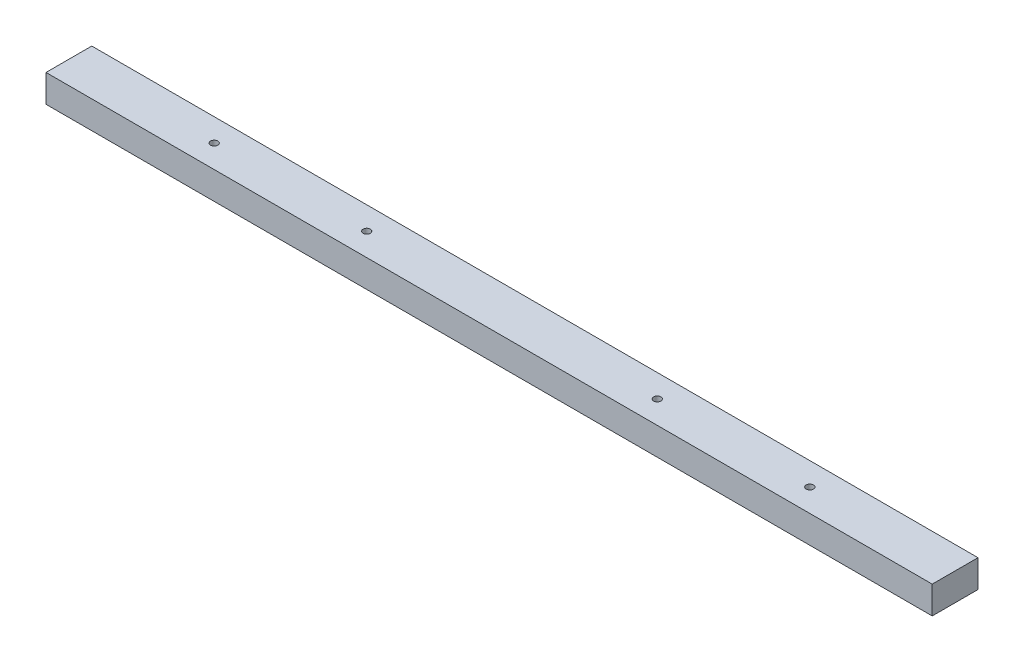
from build123d import *

# Parameters (mm, degrees)
SKETCH1_W           = 1220
SKETCH1_H           = 63
BOSS_EXTRUDE1_DEPTH = 38
SKETCH2_R           = 5
CUT_EXTRUDE1_DEPTH  = 38


with BuildPart() as part:
    # Sketch1 → Boss-Extrude1 (new body)
    with BuildSketch(Plane(origin=(0, 0, 0), x_dir=(1, 0, 0), z_dir=(0, 1, 0))):
        with Locations((610, 31.5)):
            Rectangle(SKETCH1_W, SKETCH1_H)
    extrude(amount=BOSS_EXTRUDE1_DEPTH)

    # Sketch2 → Cut-Extrude1 (cut)
    with BuildSketch(Plane(origin=(0, 38, 0), x_dir=(1, 0, 0), z_dir=(0, 1, 0))):
        with Locations(Location((200, 31.5, 0), (0, 0, 270))):
            Circle(SKETCH2_R)
        with Locations(Location((410, 31.5, 0), (0, 0, 270))):
            Circle(SKETCH2_R)
        with Locations(Location((810, 31.5, 0), (0, 0, 90))):
            Circle(SKETCH2_R)
        with Locations(Location((1020, 31.5, 0), (0, 0, 90))):
            Circle(SKETCH2_R)
    extrude(amount=-CUT_EXTRUDE1_DEPTH, mode=Mode.SUBTRACT)


solid = part.part
